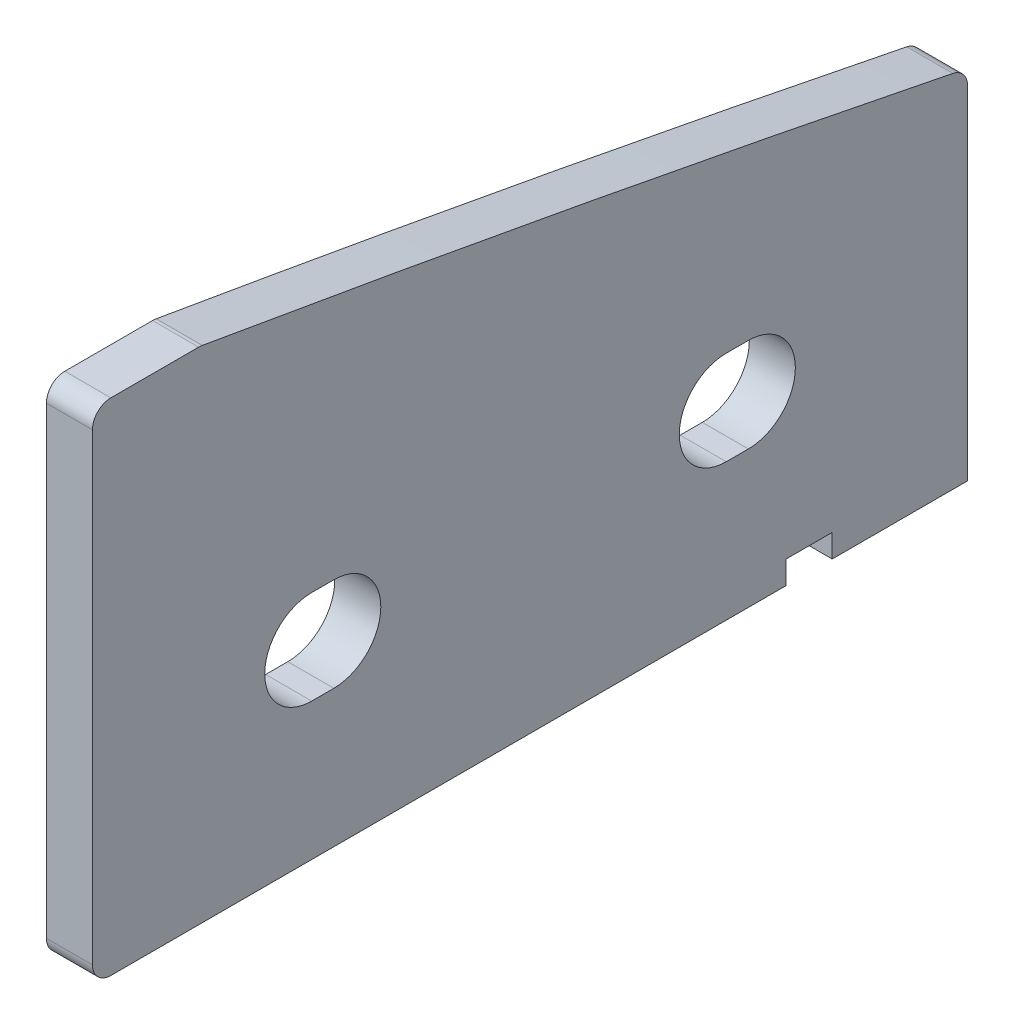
ISO-10303-21;
HEADER;
FILE_DESCRIPTION(('STEP AP214'),'2;1');
FILE_NAME('part.step','',(''),(''),'','','');
FILE_SCHEMA(('AUTOMOTIVE_DESIGN { 1 0 10303 214 1 1 1 1 }'));
ENDSEC;
DATA;
#1=APPLICATION_CONTEXT('core data for automotive mechanical design processes');
#2=APPLICATION_PROTOCOL_DEFINITION('international standard','automotive_design',2000,#1);
#3=PRODUCT_CONTEXT('',#1,'mechanical');
#4=PRODUCT('Part','Part','',(#3));
#5=PRODUCT_RELATED_PRODUCT_CATEGORY('part','',(#4));
#6=PRODUCT_DEFINITION_FORMATION('','',#4);
#7=PRODUCT_DEFINITION_CONTEXT('part definition',#1,'design');
#8=PRODUCT_DEFINITION('design','',#6,#7);
#9=PRODUCT_DEFINITION_SHAPE('','',#8);
#10=(LENGTH_UNIT() NAMED_UNIT(*) SI_UNIT(.MILLI.,.METRE.));
#11=(NAMED_UNIT(*) PLANE_ANGLE_UNIT() SI_UNIT($,.RADIAN.));
#12=(NAMED_UNIT(*) SI_UNIT($,.STERADIAN.) SOLID_ANGLE_UNIT());
#13=UNCERTAINTY_MEASURE_WITH_UNIT(LENGTH_MEASURE(1.E-05),#10,'distance_accuracy_value','');
#14=(GEOMETRIC_REPRESENTATION_CONTEXT(3) GLOBAL_UNCERTAINTY_ASSIGNED_CONTEXT((#13)) GLOBAL_UNIT_ASSIGNED_CONTEXT((#10,
#11,#12)) REPRESENTATION_CONTEXT('',''));
#15=CARTESIAN_POINT('',(0.,0.,0.));
#16=DIRECTION('',(0.,0.,1.));
#17=DIRECTION('',(1.,0.,0.));
#18=AXIS2_PLACEMENT_3D('',#15,#16,#17);
#19=CARTESIAN_POINT('',(-237.157996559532,-50.927,60.0465039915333));
#20=DIRECTION('',(0.,-1.,0.));
#21=DIRECTION('',(0.,0.,-1.));
#22=AXIS2_PLACEMENT_3D('',#19,#20,#21);
#23=PLANE('',#22);
#24=DIRECTION('',(1.,0.,0.));
#25=VECTOR('',#24,1.);
#26=CARTESIAN_POINT('',(-237.157996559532,-50.927,57.5065039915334));
#27=LINE('',#26,#25);
#28=CARTESIAN_POINT('',(-237.157996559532,-50.927,57.5065039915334));
#29=VERTEX_POINT('',#28);
#30=CARTESIAN_POINT('',(-230.807996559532,-50.927,57.5065039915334));
#31=VERTEX_POINT('',#30);
#32=EDGE_CURVE('E12',#29,#31,#27,.T.);
#33=ORIENTED_EDGE('',*,*,#32,.F.);
#34=DIRECTION('',(0.,0.,-1.));
#35=VECTOR('',#34,1.);
#36=CARTESIAN_POINT('',(-237.157996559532,-50.927,60.0465039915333));
#37=LINE('',#36,#35);
#38=CARTESIAN_POINT('',(-237.157996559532,-50.927,-35.5883444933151));
#39=VERTEX_POINT('',#38);
#40=EDGE_CURVE('E167',#29,#39,#37,.T.);
#41=ORIENTED_EDGE('',*,*,#40,.T.);
#42=DIRECTION('',(1.,0.,0.));
#43=VECTOR('',#42,1.);
#44=CARTESIAN_POINT('',(-237.157996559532,-50.927,-35.5883444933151));
#45=LINE('',#44,#43);
#46=CARTESIAN_POINT('',(-230.807996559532,-50.927,-35.5883444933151));
#47=VERTEX_POINT('',#46);
#48=EDGE_CURVE('E60',#39,#47,#45,.T.);
#49=ORIENTED_EDGE('',*,*,#48,.T.);
#50=DIRECTION('',(0.,0.,-1.));
#51=VECTOR('',#50,1.);
#52=CARTESIAN_POINT('',(-230.807996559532,-50.927,60.0465039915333));
#53=LINE('',#52,#51);
#54=EDGE_CURVE('E165',#31,#47,#53,.T.);
#55=ORIENTED_EDGE('',*,*,#54,.F.);
#56=EDGE_LOOP('',(#33,#41,#49,#55));
#57=FACE_BOUND('',#56,.T.);
#58=ADVANCED_FACE('F50',(#57),#23,.T.);
#59=CARTESIAN_POINT('',(-237.157996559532,-50.9270000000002,-35.5883444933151));
#60=DIRECTION('',(0.,0.,1.));
#61=DIRECTION('',(0.,-1.,0.));
#62=AXIS2_PLACEMENT_3D('',#59,#60,#61);
#63=PLANE('',#62);
#64=ORIENTED_EDGE('',*,*,#48,.F.);
#65=DIRECTION('',(0.,-1.,0.));
#66=VECTOR('',#65,1.);
#67=CARTESIAN_POINT('',(-237.157996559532,-50.9270000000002,-35.5883444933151));
#68=LINE('',#67,#66);
#69=CARTESIAN_POINT('',(-237.157996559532,-47.752,-35.5883444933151));
#70=VERTEX_POINT('',#69);
#71=EDGE_CURVE('E298',#70,#39,#68,.T.);
#72=ORIENTED_EDGE('',*,*,#71,.F.);
#73=DIRECTION('',(1.,0.,0.));
#74=VECTOR('',#73,1.);
#75=CARTESIAN_POINT('',(-237.157996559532,-47.752,-35.5883444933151));
#76=LINE('',#75,#74);
#77=CARTESIAN_POINT('',(-230.807996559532,-47.752,-35.5883444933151));
#78=VERTEX_POINT('',#77);
#79=EDGE_CURVE('E161',#70,#78,#76,.T.);
#80=ORIENTED_EDGE('',*,*,#79,.T.);
#81=DIRECTION('',(0.,1.,0.));
#82=VECTOR('',#81,1.);
#83=CARTESIAN_POINT('',(-230.807996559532,-50.927,-35.5883444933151));
#84=LINE('',#83,#82);
#85=EDGE_CURVE('E174',#78,#47,#84,.F.);
#86=ORIENTED_EDGE('',*,*,#85,.T.);
#87=EDGE_LOOP('',(#64,#72,#80,#86));
#88=FACE_BOUND('',#87,.T.);
#89=ADVANCED_FACE('F180',(#88),#63,.F.);
#90=CARTESIAN_POINT('',(-237.157996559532,-47.752,60.0465039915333));
#91=DIRECTION('',(0.,1.,0.));
#92=DIRECTION('',(0.,0.,1.));
#93=AXIS2_PLACEMENT_3D('',#90,#91,#92);
#94=PLANE('',#93);
#95=ORIENTED_EDGE('',*,*,#79,.F.);
#96=DIRECTION('',(0.,0.,1.));
#97=VECTOR('',#96,1.);
#98=CARTESIAN_POINT('',(-237.157996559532,-47.752,60.0465039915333));
#99=LINE('',#98,#97);
#100=CARTESIAN_POINT('',(-237.157996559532,-47.752,-41.9383444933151));
#101=VERTEX_POINT('',#100);
#102=EDGE_CURVE('E295',#101,#70,#99,.T.);
#103=ORIENTED_EDGE('',*,*,#102,.F.);
#104=DIRECTION('',(1.,0.,0.));
#105=VECTOR('',#104,1.);
#106=CARTESIAN_POINT('',(-237.157996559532,-47.752,-41.9383444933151));
#107=LINE('',#106,#105);
#108=CARTESIAN_POINT('',(-230.807996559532,-47.752,-41.9383444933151));
#109=VERTEX_POINT('',#108);
#110=EDGE_CURVE('E475',#101,#109,#107,.T.);
#111=ORIENTED_EDGE('',*,*,#110,.T.);
#112=DIRECTION('',(0.,0.,-1.));
#113=VECTOR('',#112,1.);
#114=CARTESIAN_POINT('',(-230.807996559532,-47.752,60.0465039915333));
#115=LINE('',#114,#113);
#116=EDGE_CURVE('E181',#109,#78,#115,.F.);
#117=ORIENTED_EDGE('',*,*,#116,.T.);
#118=EDGE_LOOP('',(#95,#103,#111,#117));
#119=FACE_BOUND('',#118,.T.);
#120=ADVANCED_FACE('F484',(#119),#94,.F.);
#121=CARTESIAN_POINT('',(-237.157996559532,-50.927,-41.9383444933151));
#122=DIRECTION('',(0.,0.,-1.));
#123=DIRECTION('',(0.,1.,0.));
#124=AXIS2_PLACEMENT_3D('',#121,#122,#123);
#125=PLANE('',#124);
#126=ORIENTED_EDGE('',*,*,#110,.F.);
#127=DIRECTION('',(0.,1.,0.));
#128=VECTOR('',#127,1.);
#129=CARTESIAN_POINT('',(-237.157996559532,-50.927,-41.9383444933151));
#130=LINE('',#129,#128);
#131=CARTESIAN_POINT('',(-237.157996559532,-50.927,-41.9383444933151));
#132=VERTEX_POINT('',#131);
#133=EDGE_CURVE('E292',#132,#101,#130,.T.);
#134=ORIENTED_EDGE('',*,*,#133,.F.);
#135=DIRECTION('',(1.,0.,0.));
#136=VECTOR('',#135,1.);
#137=CARTESIAN_POINT('',(-237.157996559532,-50.927,-41.9383444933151));
#138=LINE('',#137,#136);
#139=CARTESIAN_POINT('',(-230.807996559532,-50.927,-41.9383444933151));
#140=VERTEX_POINT('',#139);
#141=EDGE_CURVE('E473',#132,#140,#138,.T.);
#142=ORIENTED_EDGE('',*,*,#141,.T.);
#143=DIRECTION('',(0.,1.,0.));
#144=VECTOR('',#143,1.);
#145=CARTESIAN_POINT('',(-230.807996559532,-50.927,-41.9383444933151));
#146=LINE('',#145,#144);
#147=EDGE_CURVE('E185',#140,#109,#146,.T.);
#148=ORIENTED_EDGE('',*,*,#147,.T.);
#149=EDGE_LOOP('',(#126,#134,#142,#148));
#150=FACE_BOUND('',#149,.T.);
#151=ADVANCED_FACE('F489',(#150),#125,.F.);
#152=ORIENTED_EDGE('',*,*,#141,.F.);
#153=CARTESIAN_POINT('',(-237.157996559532,-50.927,-60.6034960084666));
#154=VERTEX_POINT('',#153);
#155=EDGE_CURVE('E203',#132,#154,#37,.T.);
#156=ORIENTED_EDGE('',*,*,#155,.T.);
#157=DIRECTION('',(1.,0.,0.));
#158=VECTOR('',#157,1.);
#159=CARTESIAN_POINT('',(-237.157996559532,-50.927,-60.6034960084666));
#160=LINE('',#159,#158);
#161=CARTESIAN_POINT('',(-230.807996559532,-50.927,-60.6034960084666));
#162=VERTEX_POINT('',#161);
#163=EDGE_CURVE('E143',#154,#162,#160,.T.);
#164=ORIENTED_EDGE('',*,*,#163,.T.);
#165=DIRECTION('',(0.,0.,-1.));
#166=VECTOR('',#165,1.);
#167=CARTESIAN_POINT('',(-230.807996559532,-50.927,60.0465039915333));
#168=LINE('',#167,#166);
#169=EDGE_CURVE('E178',#140,#162,#168,.T.);
#170=ORIENTED_EDGE('',*,*,#169,.F.);
#171=EDGE_LOOP('',(#152,#156,#164,#170));
#172=FACE_BOUND('',#171,.T.);
#173=ADVANCED_FACE('F593',(#172),#23,.T.);
#174=CARTESIAN_POINT('',(-237.157996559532,-50.927,-60.6034960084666));
#175=DIRECTION('',(0.,0.,-1.));
#176=DIRECTION('',(0.,1.,0.));
#177=AXIS2_PLACEMENT_3D('',#174,#175,#176);
#178=PLANE('',#177);
#179=ORIENTED_EDGE('',*,*,#163,.F.);
#180=DIRECTION('',(0.,1.,0.));
#181=VECTOR('',#180,1.);
#182=CARTESIAN_POINT('',(-237.157996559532,-50.927,-60.6034960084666));
#183=LINE('',#182,#181);
#184=CARTESIAN_POINT('',(-237.157996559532,-3.75079624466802,-60.6034960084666));
#185=VERTEX_POINT('',#184);
#186=EDGE_CURVE('E202',#154,#185,#183,.T.);
#187=ORIENTED_EDGE('',*,*,#186,.T.);
#188=CARTESIAN_POINT('',(-230.807996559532,-3.75079624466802,-60.6034960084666));
#189=CARTESIAN_POINT('',(-237.157996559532,-3.75079624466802,-60.6034960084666));
#190=B_SPLINE_CURVE_WITH_KNOTS('',1,(#188,#189),.UNSPECIFIED.,.F.,.F.,(2,2),(0.,1.),.UNSPECIFIED.);
#191=CARTESIAN_POINT('',(-230.807996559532,-3.75079624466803,-60.6034960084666));
#192=VERTEX_POINT('',#191);
#193=EDGE_CURVE('E469',#185,#192,#190,.F.);
#194=ORIENTED_EDGE('',*,*,#193,.T.);
#195=DIRECTION('',(0.,1.,0.));
#196=VECTOR('',#195,1.);
#197=CARTESIAN_POINT('',(-230.807996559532,-50.927,-60.6034960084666));
#198=LINE('',#197,#196);
#199=EDGE_CURVE('E177',#162,#192,#198,.T.);
#200=ORIENTED_EDGE('',*,*,#199,.F.);
#201=EDGE_LOOP('',(#179,#187,#194,#200));
#202=FACE_BOUND('',#201,.T.);
#203=ADVANCED_FACE('F413',(#202),#178,.T.);
#204=CARTESIAN_POINT('',(-230.807996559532,-3.75079624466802,-60.6034960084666));
#205=CARTESIAN_POINT('',(-230.807996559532,-3.16558969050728,-60.6034960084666));
#206=CARTESIAN_POINT('',(-230.807996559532,-2.59594110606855,-60.4005869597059));
#207=CARTESIAN_POINT('',(-230.807996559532,-1.68821148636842,-59.6578148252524));
#208=CARTESIAN_POINT('',(-230.807996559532,-1.3769441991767,-59.1395046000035));
#209=CARTESIAN_POINT('',(-230.807996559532,-1.26113049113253,-58.5675436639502));
#210=CARTESIAN_POINT('',(-237.157996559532,-3.75079624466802,-60.6034960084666));
#211=CARTESIAN_POINT('',(-237.157996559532,-3.16558969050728,-60.6034960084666));
#212=CARTESIAN_POINT('',(-237.157996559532,-2.59594110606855,-60.4005869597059));
#213=CARTESIAN_POINT('',(-237.157996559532,-1.68821148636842,-59.6578148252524));
#214=CARTESIAN_POINT('',(-237.157996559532,-1.3769441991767,-59.1395046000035));
#215=CARTESIAN_POINT('',(-237.157996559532,-1.26113049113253,-58.5675436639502));
#216=B_SPLINE_SURFACE_WITH_KNOTS('',1,3,((#204,#205,#206,#207,#208,#209),(#210,#211,#212,#213,
#214,#215)),.UNSPECIFIED.,.F.,.F.,.F.,(2,2),(4,2,4),(0.,1.),(0.,0.5,1.),.UNSPECIFIED.);
#217=CARTESIAN_POINT('',(-237.157996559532,-3.75079624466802,-60.6034960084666));
#218=CARTESIAN_POINT('',(-237.157996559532,-3.16558969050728,-60.6034960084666));
#219=CARTESIAN_POINT('',(-237.157996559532,-2.59594110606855,-60.4005869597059));
#220=CARTESIAN_POINT('',(-237.157996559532,-1.68821148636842,-59.6578148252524));
#221=CARTESIAN_POINT('',(-237.157996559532,-1.3769441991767,-59.1395046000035));
#222=CARTESIAN_POINT('',(-237.157996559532,-1.26113049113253,-58.5675436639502));
#223=B_SPLINE_CURVE_WITH_KNOTS('',3,(#217,#218,#219,#220,#221,#222),.UNSPECIFIED.,.F.,.F.,(4,2,
4),(0.,0.5,1.),.UNSPECIFIED.);
#224=CARTESIAN_POINT('',(-237.157996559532,-1.26127683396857,-58.5682665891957));
#225=VERTEX_POINT('',#224);
#226=EDGE_CURVE('E210',#185,#225,#223,.T.);
#227=CARTESIAN_POINT('',(-237.157996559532,-1.26127697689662,-58.5682665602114));
#228=CARTESIAN_POINT('',(-230.807996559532,-1.26127697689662,-58.5682665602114));
#229=B_SPLINE_CURVE_WITH_KNOTS('',1,(#227,#228),.UNSPECIFIED.,.F.,.F.,(2,2),(0.,1.),.UNSPECIFIED.);
#230=CARTESIAN_POINT('',(-230.807996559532,-1.26127683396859,-58.5682665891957));
#231=VERTEX_POINT('',#230);
#232=EDGE_CURVE('E396',#225,#231,#229,.T.);
#233=CARTESIAN_POINT('',(-230.807996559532,-1.26113049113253,-58.5675436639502));
#234=CARTESIAN_POINT('',(-230.807996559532,-1.3769441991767,-59.1395046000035));
#235=CARTESIAN_POINT('',(-230.807996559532,-1.68821148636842,-59.6578148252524));
#236=CARTESIAN_POINT('',(-230.807996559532,-2.59594110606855,-60.4005869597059));
#237=CARTESIAN_POINT('',(-230.807996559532,-3.16558969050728,-60.6034960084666));
#238=CARTESIAN_POINT('',(-230.807996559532,-3.75079624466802,-60.6034960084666));
#239=B_SPLINE_CURVE_WITH_KNOTS('',3,(#233,#234,#235,#236,#237,#238),.UNSPECIFIED.,.F.,.F.,(4,2,
4),(0.,0.5,1.),.UNSPECIFIED.);
#240=EDGE_CURVE('E198',#192,#231,#239,.F.);
#241=ORIENTED_EDGE('',*,*,#193,.F.);
#242=ORIENTED_EDGE('',*,*,#226,.T.);
#243=ORIENTED_EDGE('',*,*,#232,.T.);
#244=ORIENTED_EDGE('',*,*,#240,.F.);
#245=EDGE_LOOP('',(#241,#242,#243,#244));
#246=FACE_BOUND('',#245,.T.);
#247=ADVANCED_FACE('F402',(#246),#216,.T.);
#248=CARTESIAN_POINT('',(-230.807996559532,-1.26142317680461,-58.5689895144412));
#249=CARTESIAN_POINT('',(-230.807996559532,5.74213504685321,-23.9811042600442));
#250=CARTESIAN_POINT('',(-230.807996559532,12.162896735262,10.5098166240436));
#251=CARTESIAN_POINT('',(-230.807996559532,18.0008618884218,44.9037731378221));
#252=CARTESIAN_POINT('',(-237.157996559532,-1.26142317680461,-58.5689895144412));
#253=CARTESIAN_POINT('',(-237.157996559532,5.74213504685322,-23.9811042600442));
#254=CARTESIAN_POINT('',(-237.157996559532,12.162896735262,10.5098166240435));
#255=CARTESIAN_POINT('',(-237.157996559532,18.0008618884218,44.9037731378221));
#256=B_SPLINE_SURFACE_WITH_KNOTS('',1,3,((#248,#249,#250,#251),(#252,#253,#254,#255)),
.UNSPECIFIED.,.F.,.F.,.F.,(2,2),(4,4),(0.,1.),(0.0168086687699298,0.874129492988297),.UNSPECIFIED.);
#257=CARTESIAN_POINT('',(-237.157996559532,-1.26142317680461,-58.5689895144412));
#258=CARTESIAN_POINT('',(-237.157996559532,5.74213504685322,-23.9811042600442));
#259=CARTESIAN_POINT('',(-237.157996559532,12.162896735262,10.5098166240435));
#260=CARTESIAN_POINT('',(-237.157996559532,18.0008618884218,44.9037731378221));
#261=B_SPLINE_CURVE_WITH_KNOTS('',3,(#257,#258,#259,#260),.UNSPECIFIED.,.F.,.F.,(4,4),
(0.0168086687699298,0.874129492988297),.UNSPECIFIED.);
#262=CARTESIAN_POINT('',(-237.157996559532,18.0008584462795,44.9037737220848));
#263=VERTEX_POINT('',#262);
#264=EDGE_CURVE('E258',#225,#263,#261,.T.);
#265=CARTESIAN_POINT('',(-237.157996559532,18.0008618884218,44.9037731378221));
#266=CARTESIAN_POINT('',(-230.807996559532,18.0008618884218,44.9037731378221));
#267=B_SPLINE_CURVE_WITH_KNOTS('',1,(#265,#266),.UNSPECIFIED.,.F.,.F.,(2,2),(0.,1.),.UNSPECIFIED.);
#268=CARTESIAN_POINT('',(-230.807996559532,18.0008584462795,44.9037737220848));
#269=VERTEX_POINT('',#268);
#270=EDGE_CURVE('E374',#263,#269,#267,.T.);
#271=CARTESIAN_POINT('',(-230.807996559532,18.0008618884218,44.9037731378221));
#272=CARTESIAN_POINT('',(-230.807996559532,12.162896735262,10.5098166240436));
#273=CARTESIAN_POINT('',(-230.807996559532,5.74213504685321,-23.9811042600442));
#274=CARTESIAN_POINT('',(-230.807996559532,-1.26142317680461,-58.5689895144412));
#275=B_SPLINE_CURVE_WITH_KNOTS('',3,(#271,#272,#273,#274),.UNSPECIFIED.,.F.,.F.,(4,4),
(0.0168086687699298,0.874129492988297),.UNSPECIFIED.);
#276=EDGE_CURVE('E514',#231,#269,#275,.F.);
#277=ORIENTED_EDGE('',*,*,#232,.F.);
#278=ORIENTED_EDGE('',*,*,#264,.T.);
#279=ORIENTED_EDGE('',*,*,#270,.T.);
#280=ORIENTED_EDGE('',*,*,#276,.F.);
#281=EDGE_LOOP('',(#277,#278,#279,#280));
#282=FACE_BOUND('',#281,.T.);
#283=ADVANCED_FACE('F328',(#282),#256,.T.);
#284=CARTESIAN_POINT('',(-230.807996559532,18.0008584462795,44.9037737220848));
#285=CARTESIAN_POINT('',(-230.807996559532,18.0291271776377,45.0703165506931));
#286=CARTESIAN_POINT('',(-230.807996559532,18.0432615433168,45.2382941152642));
#287=CARTESIAN_POINT('',(-230.807996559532,18.0432615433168,45.4077064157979));
#288=CARTESIAN_POINT('',(-237.157996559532,18.0008584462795,44.9037737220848));
#289=CARTESIAN_POINT('',(-237.157996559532,18.0291271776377,45.0703165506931));
#290=CARTESIAN_POINT('',(-237.157996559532,18.0432615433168,45.2382941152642));
#291=CARTESIAN_POINT('',(-237.157996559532,18.0432615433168,45.4077064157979));
#292=B_SPLINE_SURFACE_WITH_KNOTS('',1,3,((#284,#285,#286,#287),(#288,#289,#290,#291)),
.UNSPECIFIED.,.F.,.F.,.F.,(2,2),(4,4),(0.,1.),(0.,1.),.UNSPECIFIED.);
#293=CARTESIAN_POINT('',(-237.157996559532,18.0008584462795,44.9037737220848));
#294=CARTESIAN_POINT('',(-237.157996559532,18.0291271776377,45.0703165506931));
#295=CARTESIAN_POINT('',(-237.157996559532,18.0432615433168,45.2382941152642));
#296=CARTESIAN_POINT('',(-237.157996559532,18.0432615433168,45.4077064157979));
#297=B_SPLINE_CURVE_WITH_KNOTS('',3,(#293,#294,#295,#296),.UNSPECIFIED.,.F.,.F.,(4,4),(0.,1.),.UNSPECIFIED.);
#298=CARTESIAN_POINT('',(-237.157996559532,18.0432615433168,45.4077064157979));
#299=VERTEX_POINT('',#298);
#300=EDGE_CURVE('E253',#263,#299,#297,.T.);
#301=CARTESIAN_POINT('',(-237.157996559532,18.0432615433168,45.4077064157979));
#302=CARTESIAN_POINT('',(-230.807996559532,18.0432615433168,45.4077064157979));
#303=B_SPLINE_CURVE_WITH_KNOTS('',1,(#301,#302),.UNSPECIFIED.,.F.,.F.,(2,2),(0.,1.),.UNSPECIFIED.);
#304=CARTESIAN_POINT('',(-230.807996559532,18.0432615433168,45.4077064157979));
#305=VERTEX_POINT('',#304);
#306=EDGE_CURVE('E361',#299,#305,#303,.T.);
#307=CARTESIAN_POINT('',(-230.807996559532,18.0432615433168,45.4077064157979));
#308=CARTESIAN_POINT('',(-230.807996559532,18.0432615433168,45.2382941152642));
#309=CARTESIAN_POINT('',(-230.807996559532,18.0291271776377,45.0703165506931));
#310=CARTESIAN_POINT('',(-230.807996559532,18.0008584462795,44.9037737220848));
#311=B_SPLINE_CURVE_WITH_KNOTS('',3,(#307,#308,#309,#310),.UNSPECIFIED.,.F.,.F.,(4,4),(0.,1.),.UNSPECIFIED.);
#312=EDGE_CURVE('E193',#269,#305,#311,.F.);
#313=ORIENTED_EDGE('',*,*,#270,.F.);
#314=ORIENTED_EDGE('',*,*,#300,.T.);
#315=ORIENTED_EDGE('',*,*,#306,.T.);
#316=ORIENTED_EDGE('',*,*,#312,.F.);
#317=EDGE_LOOP('',(#313,#314,#315,#316));
#318=FACE_BOUND('',#317,.T.);
#319=ADVANCED_FACE('F315',(#318),#292,.T.);
#320=CARTESIAN_POINT('',(-237.157996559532,18.0432615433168,60.0465039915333));
#321=DIRECTION('',(0.,-1.,0.));
#322=DIRECTION('',(0.,0.,-1.));
#323=AXIS2_PLACEMENT_3D('',#320,#321,#322);
#324=PLANE('',#323);
#325=ORIENTED_EDGE('',*,*,#306,.F.);
#326=DIRECTION('',(0.,0.,-1.));
#327=VECTOR('',#326,1.);
#328=CARTESIAN_POINT('',(-237.157996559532,18.0432615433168,60.0465039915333));
#329=LINE('',#328,#327);
#330=CARTESIAN_POINT('',(-237.157996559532,18.0432615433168,57.5065039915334));
#331=VERTEX_POINT('',#330);
#332=EDGE_CURVE('E244',#331,#299,#329,.T.);
#333=ORIENTED_EDGE('',*,*,#332,.F.);
#334=DIRECTION('',(1.,0.,0.));
#335=VECTOR('',#334,1.);
#336=CARTESIAN_POINT('',(-237.157996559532,18.0432615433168,57.5065039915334));
#337=LINE('',#336,#335);
#338=CARTESIAN_POINT('',(-230.807996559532,18.0432615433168,57.5065039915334));
#339=VERTEX_POINT('',#338);
#340=EDGE_CURVE('E464',#331,#339,#337,.T.);
#341=ORIENTED_EDGE('',*,*,#340,.T.);
#342=DIRECTION('',(0.,0.,-1.));
#343=VECTOR('',#342,1.);
#344=CARTESIAN_POINT('',(-230.807996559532,18.0432615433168,60.0465039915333));
#345=LINE('',#344,#343);
#346=EDGE_CURVE('E189',#339,#305,#345,.T.);
#347=ORIENTED_EDGE('',*,*,#346,.T.);
#348=EDGE_LOOP('',(#325,#333,#341,#347));
#349=FACE_BOUND('',#348,.T.);
#350=ADVANCED_FACE('F327',(#349),#324,.F.);
#351=CARTESIAN_POINT('',(-237.157996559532,15.5032615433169,57.5065039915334));
#352=DIRECTION('',(1.,0.,0.));
#353=DIRECTION('',(0.,0.,-1.));
#354=AXIS2_PLACEMENT_3D('',#351,#352,#353);
#355=CYLINDRICAL_SURFACE('',#354,2.54);
#356=ORIENTED_EDGE('',*,*,#340,.F.);
#357=CARTESIAN_POINT('',(-237.157996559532,15.5032615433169,57.5065039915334));
#358=DIRECTION('',(1.,0.,0.));
#359=DIRECTION('',(0.,0.,-1.));
#360=AXIS2_PLACEMENT_3D('',#357,#358,#359);
#361=CIRCLE('',#360,2.54);
#362=CARTESIAN_POINT('',(-237.157996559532,15.5032615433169,60.0465039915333));
#363=VERTEX_POINT('',#362);
#364=EDGE_CURVE('E252',#331,#363,#361,.T.);
#365=ORIENTED_EDGE('',*,*,#364,.T.);
#366=DIRECTION('',(1.,0.,0.));
#367=VECTOR('',#366,1.);
#368=CARTESIAN_POINT('',(-237.157996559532,15.5032615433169,60.0465039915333));
#369=LINE('',#368,#367);
#370=CARTESIAN_POINT('',(-230.807996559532,15.5032615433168,60.0465039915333));
#371=VERTEX_POINT('',#370);
#372=EDGE_CURVE('E462',#363,#371,#369,.T.);
#373=ORIENTED_EDGE('',*,*,#372,.T.);
#374=CARTESIAN_POINT('',(-230.807996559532,15.5032615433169,57.5065039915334));
#375=DIRECTION('',(1.,0.,0.));
#376=DIRECTION('',(0.,0.,-1.));
#377=AXIS2_PLACEMENT_3D('',#374,#375,#376);
#378=CIRCLE('',#377,2.54);
#379=EDGE_CURVE('E192',#339,#371,#378,.T.);
#380=ORIENTED_EDGE('',*,*,#379,.F.);
#381=EDGE_LOOP('',(#356,#365,#373,#380));
#382=FACE_BOUND('',#381,.T.);
#383=ADVANCED_FACE('F578',(#382),#355,.T.);
#384=CARTESIAN_POINT('',(-237.157996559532,-50.927,60.0465039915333));
#385=DIRECTION('',(0.,0.,-1.));
#386=DIRECTION('',(0.,1.,0.));
#387=AXIS2_PLACEMENT_3D('',#384,#385,#386);
#388=PLANE('',#387);
#389=ORIENTED_EDGE('',*,*,#372,.F.);
#390=DIRECTION('',(0.,1.,0.));
#391=VECTOR('',#390,1.);
#392=CARTESIAN_POINT('',(-237.157996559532,-50.927,60.0465039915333));
#393=LINE('',#392,#391);
#394=CARTESIAN_POINT('',(-237.157996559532,-48.387,60.0465039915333));
#395=VERTEX_POINT('',#394);
#396=EDGE_CURVE('E206',#395,#363,#393,.T.);
#397=ORIENTED_EDGE('',*,*,#396,.F.);
#398=DIRECTION('',(1.,0.,0.));
#399=VECTOR('',#398,1.);
#400=CARTESIAN_POINT('',(-237.157996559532,-48.387,60.0465039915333));
#401=LINE('',#400,#399);
#402=CARTESIAN_POINT('',(-230.807996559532,-48.387,60.0465039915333));
#403=VERTEX_POINT('',#402);
#404=EDGE_CURVE('E54',#395,#403,#401,.T.);
#405=ORIENTED_EDGE('',*,*,#404,.T.);
#406=DIRECTION('',(0.,1.,0.));
#407=VECTOR('',#406,1.);
#408=CARTESIAN_POINT('',(-230.807996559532,-50.927,60.0465039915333));
#409=LINE('',#408,#407);
#410=EDGE_CURVE('E302',#403,#371,#409,.T.);
#411=ORIENTED_EDGE('',*,*,#410,.T.);
#412=EDGE_LOOP('',(#389,#397,#405,#411));
#413=FACE_BOUND('',#412,.T.);
#414=ADVANCED_FACE('F582',(#413),#388,.F.);
#415=CARTESIAN_POINT('',(-237.157996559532,-25.527,-27.3294960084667));
#416=DIRECTION('',(1.,0.,0.));
#417=DIRECTION('',(0.,0.,-1.));
#418=AXIS2_PLACEMENT_3D('',#415,#416,#417);
#419=CYLINDRICAL_SURFACE('',#418,6.477);
#420=DIRECTION('',(1.,0.,0.));
#421=VECTOR('',#420,1.);
#422=CARTESIAN_POINT('',(-237.157996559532,-32.004,-27.3294960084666));
#423=LINE('',#422,#421);
#424=CARTESIAN_POINT('',(-237.157996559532,-32.004,-27.3294960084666));
#425=VERTEX_POINT('',#424);
#426=CARTESIAN_POINT('',(-230.807996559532,-32.004,-27.3294960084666));
#427=VERTEX_POINT('',#426);
#428=EDGE_CURVE('E457',#425,#427,#423,.T.);
#429=ORIENTED_EDGE('',*,*,#428,.F.);
#430=CARTESIAN_POINT('',(-237.157996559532,-25.527,-27.3294960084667));
#431=DIRECTION('',(1.,0.,0.));
#432=DIRECTION('',(0.,0.,-1.));
#433=AXIS2_PLACEMENT_3D('',#430,#431,#432);
#434=CIRCLE('',#433,6.477);
#435=CARTESIAN_POINT('',(-237.157996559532,-19.05,-27.3294960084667));
#436=VERTEX_POINT('',#435);
#437=EDGE_CURVE('E283',#436,#425,#434,.T.);
#438=ORIENTED_EDGE('',*,*,#437,.F.);
#439=DIRECTION('',(1.,0.,0.));
#440=VECTOR('',#439,1.);
#441=CARTESIAN_POINT('',(-237.157996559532,-19.05,-27.3294960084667));
#442=LINE('',#441,#440);
#443=CARTESIAN_POINT('',(-230.807996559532,-19.05,-27.3294960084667));
#444=VERTEX_POINT('',#443);
#445=EDGE_CURVE('E454',#436,#444,#442,.T.);
#446=ORIENTED_EDGE('',*,*,#445,.T.);
#447=CARTESIAN_POINT('',(-230.807996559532,-25.527,-27.3294960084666));
#448=DIRECTION('',(1.,0.,0.));
#449=DIRECTION('',(0.,0.,-1.));
#450=AXIS2_PLACEMENT_3D('',#447,#448,#449);
#451=CIRCLE('',#450,6.477);
#452=EDGE_CURVE('E531',#444,#427,#451,.T.);
#453=ORIENTED_EDGE('',*,*,#452,.T.);
#454=EDGE_LOOP('',(#429,#438,#446,#453));
#455=FACE_BOUND('',#454,.T.);
#456=ADVANCED_FACE('F646',(#455),#419,.F.);
#457=CARTESIAN_POINT('',(-237.157996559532,-19.05,60.0465039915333));
#458=DIRECTION('',(0.,1.,0.));
#459=DIRECTION('',(0.,0.,1.));
#460=AXIS2_PLACEMENT_3D('',#457,#458,#459);
#461=PLANE('',#460);
#462=ORIENTED_EDGE('',*,*,#445,.F.);
#463=DIRECTION('',(0.,0.,1.));
#464=VECTOR('',#463,1.);
#465=CARTESIAN_POINT('',(-237.157996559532,-19.05,60.0465039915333));
#466=LINE('',#465,#464);
#467=CARTESIAN_POINT('',(-237.157996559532,-19.05,-30.3774960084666));
#468=VERTEX_POINT('',#467);
#469=EDGE_CURVE('E286',#468,#436,#466,.T.);
#470=ORIENTED_EDGE('',*,*,#469,.F.);
#471=DIRECTION('',(1.,0.,0.));
#472=VECTOR('',#471,1.);
#473=CARTESIAN_POINT('',(-237.157996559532,-19.05,-30.3774960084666));
#474=LINE('',#473,#472);
#475=CARTESIAN_POINT('',(-230.807996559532,-19.05,-30.3774960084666));
#476=VERTEX_POINT('',#475);
#477=EDGE_CURVE('E451',#468,#476,#474,.T.);
#478=ORIENTED_EDGE('',*,*,#477,.T.);
#479=DIRECTION('',(0.,0.,-1.));
#480=VECTOR('',#479,1.);
#481=CARTESIAN_POINT('',(-230.807996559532,-19.05,60.0465039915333));
#482=LINE('',#481,#480);
#483=EDGE_CURVE('E492',#476,#444,#482,.F.);
#484=ORIENTED_EDGE('',*,*,#483,.T.);
#485=EDGE_LOOP('',(#462,#470,#478,#484));
#486=FACE_BOUND('',#485,.T.);
#487=ADVANCED_FACE('F653',(#486),#461,.F.);
#488=CARTESIAN_POINT('',(-237.157996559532,-25.527,-30.3774960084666));
#489=DIRECTION('',(1.,0.,0.));
#490=DIRECTION('',(0.,0.,-1.));
#491=AXIS2_PLACEMENT_3D('',#488,#489,#490);
#492=CYLINDRICAL_SURFACE('',#491,6.477);
#493=ORIENTED_EDGE('',*,*,#477,.F.);
#494=CARTESIAN_POINT('',(-237.157996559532,-25.527,-30.3774960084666));
#495=DIRECTION('',(1.,0.,0.));
#496=DIRECTION('',(0.,0.,-1.));
#497=AXIS2_PLACEMENT_3D('',#494,#495,#496);
#498=CIRCLE('',#497,6.477);
#499=CARTESIAN_POINT('',(-237.157996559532,-32.004,-30.3774960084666));
#500=VERTEX_POINT('',#499);
#501=EDGE_CURVE('E289',#500,#468,#498,.T.);
#502=ORIENTED_EDGE('',*,*,#501,.F.);
#503=DIRECTION('',(1.,0.,0.));
#504=VECTOR('',#503,1.);
#505=CARTESIAN_POINT('',(-237.157996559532,-32.004,-30.3774960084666));
#506=LINE('',#505,#504);
#507=CARTESIAN_POINT('',(-230.807996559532,-32.004,-30.3774960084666));
#508=VERTEX_POINT('',#507);
#509=EDGE_CURVE('E448',#500,#508,#506,.T.);
#510=ORIENTED_EDGE('',*,*,#509,.T.);
#511=CARTESIAN_POINT('',(-230.807996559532,-25.527,-30.3774960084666));
#512=DIRECTION('',(1.,0.,0.));
#513=DIRECTION('',(0.,0.,-1.));
#514=AXIS2_PLACEMENT_3D('',#511,#512,#513);
#515=CIRCLE('',#514,6.477);
#516=EDGE_CURVE('E490',#508,#476,#515,.T.);
#517=ORIENTED_EDGE('',*,*,#516,.T.);
#518=EDGE_LOOP('',(#493,#502,#510,#517));
#519=FACE_BOUND('',#518,.T.);
#520=ADVANCED_FACE('F661',(#519),#492,.F.);
#521=CARTESIAN_POINT('',(-237.157996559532,-25.527,29.8205039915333));
#522=DIRECTION('',(1.,0.,0.));
#523=DIRECTION('',(0.,0.,-1.));
#524=AXIS2_PLACEMENT_3D('',#521,#522,#523);
#525=CYLINDRICAL_SURFACE('',#524,6.477);
#526=DIRECTION('',(1.,0.,0.));
#527=VECTOR('',#526,1.);
#528=CARTESIAN_POINT('',(-237.157996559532,-32.004,29.8205039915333));
#529=LINE('',#528,#527);
#530=CARTESIAN_POINT('',(-237.157996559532,-32.004,29.8205039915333));
#531=VERTEX_POINT('',#530);
#532=CARTESIAN_POINT('',(-230.807996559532,-32.004,29.8205039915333));
#533=VERTEX_POINT('',#532);
#534=EDGE_CURVE('E445',#531,#533,#529,.T.);
#535=ORIENTED_EDGE('',*,*,#534,.F.);
#536=CARTESIAN_POINT('',(-237.157996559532,-25.527,29.8205039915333));
#537=DIRECTION('',(1.,0.,0.));
#538=DIRECTION('',(0.,0.,-1.));
#539=AXIS2_PLACEMENT_3D('',#536,#537,#538);
#540=CIRCLE('',#539,6.477);
#541=CARTESIAN_POINT('',(-237.157996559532,-19.05,29.8205039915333));
#542=VERTEX_POINT('',#541);
#543=EDGE_CURVE('E271',#542,#531,#540,.T.);
#544=ORIENTED_EDGE('',*,*,#543,.F.);
#545=DIRECTION('',(1.,0.,0.));
#546=VECTOR('',#545,1.);
#547=CARTESIAN_POINT('',(-237.157996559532,-19.05,29.8205039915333));
#548=LINE('',#547,#546);
#549=CARTESIAN_POINT('',(-230.807996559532,-19.05,29.8205039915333));
#550=VERTEX_POINT('',#549);
#551=EDGE_CURVE('E442',#542,#550,#548,.T.);
#552=ORIENTED_EDGE('',*,*,#551,.T.);
#553=CARTESIAN_POINT('',(-230.807996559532,-25.527,29.8205039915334));
#554=DIRECTION('',(1.,0.,0.));
#555=DIRECTION('',(0.,0.,-1.));
#556=AXIS2_PLACEMENT_3D('',#553,#554,#555);
#557=CIRCLE('',#556,6.477);
#558=EDGE_CURVE('E540',#550,#533,#557,.T.);
#559=ORIENTED_EDGE('',*,*,#558,.T.);
#560=EDGE_LOOP('',(#535,#544,#552,#559));
#561=FACE_BOUND('',#560,.T.);
#562=ADVANCED_FACE('F669',(#561),#525,.F.);
#563=CARTESIAN_POINT('',(-237.157996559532,-19.05,60.0465039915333));
#564=DIRECTION('',(0.,1.,0.));
#565=DIRECTION('',(0.,0.,1.));
#566=AXIS2_PLACEMENT_3D('',#563,#564,#565);
#567=PLANE('',#566);
#568=ORIENTED_EDGE('',*,*,#551,.F.);
#569=DIRECTION('',(0.,0.,1.));
#570=VECTOR('',#569,1.);
#571=CARTESIAN_POINT('',(-237.157996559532,-19.05,60.0465039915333));
#572=LINE('',#571,#570);
#573=CARTESIAN_POINT('',(-237.157996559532,-19.05,26.7725039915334));
#574=VERTEX_POINT('',#573);
#575=EDGE_CURVE('E274',#574,#542,#572,.T.);
#576=ORIENTED_EDGE('',*,*,#575,.F.);
#577=DIRECTION('',(1.,0.,0.));
#578=VECTOR('',#577,1.);
#579=CARTESIAN_POINT('',(-237.157996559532,-19.05,26.7725039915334));
#580=LINE('',#579,#578);
#581=CARTESIAN_POINT('',(-230.807996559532,-19.05,26.7725039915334));
#582=VERTEX_POINT('',#581);
#583=EDGE_CURVE('E434',#574,#582,#580,.T.);
#584=ORIENTED_EDGE('',*,*,#583,.T.);
#585=DIRECTION('',(0.,0.,-1.));
#586=VECTOR('',#585,1.);
#587=CARTESIAN_POINT('',(-230.807996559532,-19.05,60.0465039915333));
#588=LINE('',#587,#586);
#589=EDGE_CURVE('E543',#582,#550,#588,.F.);
#590=ORIENTED_EDGE('',*,*,#589,.T.);
#591=EDGE_LOOP('',(#568,#576,#584,#590));
#592=FACE_BOUND('',#591,.T.);
#593=ADVANCED_FACE('F677',(#592),#567,.F.);
#594=CARTESIAN_POINT('',(-237.157996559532,-25.527,26.7725039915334));
#595=DIRECTION('',(1.,0.,0.));
#596=DIRECTION('',(0.,0.,-1.));
#597=AXIS2_PLACEMENT_3D('',#594,#595,#596);
#598=CYLINDRICAL_SURFACE('',#597,6.477);
#599=ORIENTED_EDGE('',*,*,#583,.F.);
#600=CARTESIAN_POINT('',(-237.157996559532,-25.527,26.7725039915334));
#601=DIRECTION('',(1.,0.,0.));
#602=DIRECTION('',(0.,0.,-1.));
#603=AXIS2_PLACEMENT_3D('',#600,#601,#602);
#604=CIRCLE('',#603,6.477);
#605=CARTESIAN_POINT('',(-237.157996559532,-32.004,26.7725039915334));
#606=VERTEX_POINT('',#605);
#607=EDGE_CURVE('E277',#606,#574,#604,.T.);
#608=ORIENTED_EDGE('',*,*,#607,.F.);
#609=DIRECTION('',(1.,0.,0.));
#610=VECTOR('',#609,1.);
#611=CARTESIAN_POINT('',(-237.157996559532,-32.004,26.7725039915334));
#612=LINE('',#611,#610);
#613=CARTESIAN_POINT('',(-230.807996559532,-32.004,26.7725039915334));
#614=VERTEX_POINT('',#613);
#615=EDGE_CURVE('E183',#606,#614,#612,.T.);
#616=ORIENTED_EDGE('',*,*,#615,.T.);
#617=CARTESIAN_POINT('',(-230.807996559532,-25.527,26.7725039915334));
#618=DIRECTION('',(1.,0.,0.));
#619=DIRECTION('',(0.,0.,-1.));
#620=AXIS2_PLACEMENT_3D('',#617,#618,#619);
#621=CIRCLE('',#620,6.477);
#622=EDGE_CURVE('E532',#614,#582,#621,.T.);
#623=ORIENTED_EDGE('',*,*,#622,.T.);
#624=EDGE_LOOP('',(#599,#608,#616,#623));
#625=FACE_BOUND('',#624,.T.);
#626=ADVANCED_FACE('F236',(#625),#598,.F.);
#627=CARTESIAN_POINT('',(-237.157996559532,-32.004,60.0465039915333));
#628=DIRECTION('',(0.,-1.,0.));
#629=DIRECTION('',(0.,0.,-1.));
#630=AXIS2_PLACEMENT_3D('',#627,#628,#629);
#631=PLANE('',#630);
#632=DIRECTION('',(0.,0.,-1.));
#633=VECTOR('',#632,1.);
#634=CARTESIAN_POINT('',(-237.157996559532,-32.004,60.0465039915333));
#635=LINE('',#634,#633);
#636=EDGE_CURVE('E263',#531,#606,#635,.T.);
#637=ORIENTED_EDGE('',*,*,#636,.F.);
#638=ORIENTED_EDGE('',*,*,#534,.T.);
#639=DIRECTION('',(0.,0.,-1.));
#640=VECTOR('',#639,1.);
#641=CARTESIAN_POINT('',(-230.807996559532,-32.004,60.0465039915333));
#642=LINE('',#641,#640);
#643=EDGE_CURVE('E537',#533,#614,#642,.T.);
#644=ORIENTED_EDGE('',*,*,#643,.T.);
#645=ORIENTED_EDGE('',*,*,#615,.F.);
#646=EDGE_LOOP('',(#637,#638,#644,#645));
#647=FACE_BOUND('',#646,.T.);
#648=ADVANCED_FACE('F234',(#647),#631,.F.);
#649=CARTESIAN_POINT('',(-237.157996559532,-32.004,60.0465039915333));
#650=DIRECTION('',(0.,-1.,0.));
#651=DIRECTION('',(0.,0.,-1.));
#652=AXIS2_PLACEMENT_3D('',#649,#650,#651);
#653=PLANE('',#652);
#654=DIRECTION('',(0.,0.,-1.));
#655=VECTOR('',#654,1.);
#656=CARTESIAN_POINT('',(-237.157996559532,-32.004,60.0465039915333));
#657=LINE('',#656,#655);
#658=EDGE_CURVE('E280',#425,#500,#657,.T.);
#659=ORIENTED_EDGE('',*,*,#658,.F.);
#660=ORIENTED_EDGE('',*,*,#428,.T.);
#661=DIRECTION('',(0.,0.,-1.));
#662=VECTOR('',#661,1.);
#663=CARTESIAN_POINT('',(-230.807996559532,-32.004,60.0465039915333));
#664=LINE('',#663,#662);
#665=EDGE_CURVE('E528',#427,#508,#664,.T.);
#666=ORIENTED_EDGE('',*,*,#665,.T.);
#667=ORIENTED_EDGE('',*,*,#509,.F.);
#668=EDGE_LOOP('',(#659,#660,#666,#667));
#669=FACE_BOUND('',#668,.T.);
#670=ADVANCED_FACE('F585',(#669),#653,.F.);
#671=CARTESIAN_POINT('',(-237.157996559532,-48.387,57.5065039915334));
#672=DIRECTION('',(1.,0.,0.));
#673=DIRECTION('',(0.,0.,-1.));
#674=AXIS2_PLACEMENT_3D('',#671,#672,#673);
#675=CYLINDRICAL_SURFACE('',#674,2.54);
#676=CARTESIAN_POINT('',(-237.157996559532,-48.387,57.5065039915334));
#677=DIRECTION('',(1.,0.,0.));
#678=DIRECTION('',(0.,0.,-1.));
#679=AXIS2_PLACEMENT_3D('',#676,#677,#678);
#680=CIRCLE('',#679,2.54);
#681=EDGE_CURVE('E300',#395,#29,#680,.T.);
#682=ORIENTED_EDGE('',*,*,#681,.T.);
#683=ORIENTED_EDGE('',*,*,#32,.T.);
#684=CARTESIAN_POINT('',(-230.807996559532,-48.387,57.5065039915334));
#685=DIRECTION('',(1.,0.,0.));
#686=DIRECTION('',(0.,0.,-1.));
#687=AXIS2_PLACEMENT_3D('',#684,#685,#686);
#688=CIRCLE('',#687,2.54);
#689=EDGE_CURVE('E176',#403,#31,#688,.T.);
#690=ORIENTED_EDGE('',*,*,#689,.F.);
#691=ORIENTED_EDGE('',*,*,#404,.F.);
#692=EDGE_LOOP('',(#682,#683,#690,#691));
#693=FACE_BOUND('',#692,.T.);
#694=ADVANCED_FACE('F52',(#693),#675,.T.);
#695=CARTESIAN_POINT('',(-230.807996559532,-50.927,60.0465039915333));
#696=DIRECTION('',(1.,0.,0.));
#697=DIRECTION('',(0.,0.,-1.));
#698=AXIS2_PLACEMENT_3D('',#695,#696,#697);
#699=PLANE('',#698);
#700=ORIENTED_EDGE('',*,*,#622,.F.);
#701=ORIENTED_EDGE('',*,*,#643,.F.);
#702=ORIENTED_EDGE('',*,*,#558,.F.);
#703=ORIENTED_EDGE('',*,*,#589,.F.);
#704=EDGE_LOOP('',(#700,#701,#702,#703));
#705=FACE_BOUND('',#704,.T.);
#706=ORIENTED_EDGE('',*,*,#516,.F.);
#707=ORIENTED_EDGE('',*,*,#665,.F.);
#708=ORIENTED_EDGE('',*,*,#452,.F.);
#709=ORIENTED_EDGE('',*,*,#483,.F.);
#710=EDGE_LOOP('',(#706,#707,#708,#709));
#711=FACE_BOUND('',#710,.T.);
#712=ORIENTED_EDGE('',*,*,#410,.F.);
#713=ORIENTED_EDGE('',*,*,#689,.T.);
#714=ORIENTED_EDGE('',*,*,#54,.T.);
#715=ORIENTED_EDGE('',*,*,#85,.F.);
#716=ORIENTED_EDGE('',*,*,#116,.F.);
#717=ORIENTED_EDGE('',*,*,#147,.F.);
#718=ORIENTED_EDGE('',*,*,#169,.T.);
#719=ORIENTED_EDGE('',*,*,#199,.T.);
#720=ORIENTED_EDGE('',*,*,#240,.T.);
#721=ORIENTED_EDGE('',*,*,#276,.T.);
#722=ORIENTED_EDGE('',*,*,#312,.T.);
#723=ORIENTED_EDGE('',*,*,#346,.F.);
#724=ORIENTED_EDGE('',*,*,#379,.T.);
#725=EDGE_LOOP('',(#712,#713,#714,#715,#716,#717,#718,#719,#720,#721,#722,#723,#724));
#726=FACE_BOUND('',#725,.T.);
#727=ADVANCED_FACE('F172',(#705,#711,#726),#699,.T.);
#728=CARTESIAN_POINT('',(-237.157996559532,-50.927,60.0465039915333));
#729=DIRECTION('',(1.,0.,0.));
#730=DIRECTION('',(0.,0.,-1.));
#731=AXIS2_PLACEMENT_3D('',#728,#729,#730);
#732=PLANE('',#731);
#733=ORIENTED_EDGE('',*,*,#607,.T.);
#734=ORIENTED_EDGE('',*,*,#575,.T.);
#735=ORIENTED_EDGE('',*,*,#543,.T.);
#736=ORIENTED_EDGE('',*,*,#636,.T.);
#737=EDGE_LOOP('',(#733,#734,#735,#736));
#738=FACE_BOUND('',#737,.T.);
#739=ORIENTED_EDGE('',*,*,#501,.T.);
#740=ORIENTED_EDGE('',*,*,#469,.T.);
#741=ORIENTED_EDGE('',*,*,#437,.T.);
#742=ORIENTED_EDGE('',*,*,#658,.T.);
#743=EDGE_LOOP('',(#739,#740,#741,#742));
#744=FACE_BOUND('',#743,.T.);
#745=ORIENTED_EDGE('',*,*,#396,.T.);
#746=ORIENTED_EDGE('',*,*,#364,.F.);
#747=ORIENTED_EDGE('',*,*,#332,.T.);
#748=ORIENTED_EDGE('',*,*,#300,.F.);
#749=ORIENTED_EDGE('',*,*,#264,.F.);
#750=ORIENTED_EDGE('',*,*,#226,.F.);
#751=ORIENTED_EDGE('',*,*,#186,.F.);
#752=ORIENTED_EDGE('',*,*,#155,.F.);
#753=ORIENTED_EDGE('',*,*,#133,.T.);
#754=ORIENTED_EDGE('',*,*,#102,.T.);
#755=ORIENTED_EDGE('',*,*,#71,.T.);
#756=ORIENTED_EDGE('',*,*,#40,.F.);
#757=ORIENTED_EDGE('',*,*,#681,.F.);
#758=EDGE_LOOP('',(#745,#746,#747,#748,#749,#750,#751,#752,#753,#754,#755,#756,#757));
#759=FACE_BOUND('',#758,.T.);
#760=ADVANCED_FACE('F223',(#738,#744,#759),#732,.F.);
#761=CLOSED_SHELL('',(#58,#89,#120,#151,#173,#203,#247,#283,#319,#350,#383,#414,#456,#487,#520,
#562,#593,#626,#648,#670,#694,#727,#760));
#762=MANIFOLD_SOLID_BREP('B2',#761);
#763=ADVANCED_BREP_SHAPE_REPRESENTATION('',(#18,#762),#14);
#764=SHAPE_DEFINITION_REPRESENTATION(#9,#763);
ENDSEC;
END-ISO-10303-21;
